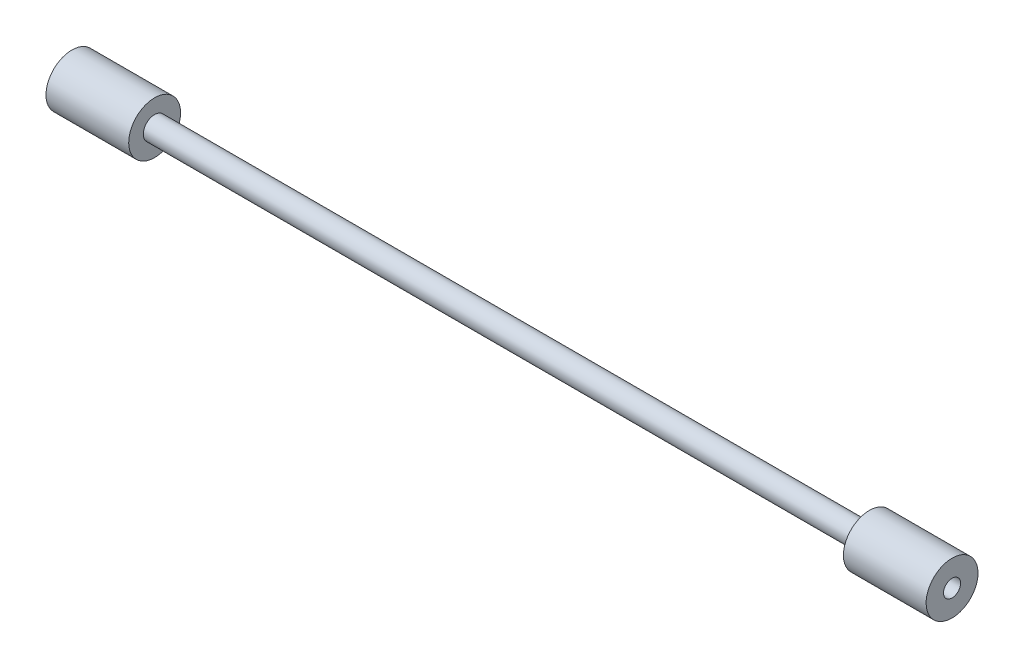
ISO-10303-21;
HEADER;
FILE_DESCRIPTION(('STEP AP214'),'2;1');
FILE_NAME('part.step','',(''),(''),'','','');
FILE_SCHEMA(('AUTOMOTIVE_DESIGN { 1 0 10303 214 1 1 1 1 }'));
ENDSEC;
DATA;
#1=APPLICATION_CONTEXT('core data for automotive mechanical design processes');
#2=APPLICATION_PROTOCOL_DEFINITION('international standard','automotive_design',2000,#1);
#3=PRODUCT_CONTEXT('',#1,'mechanical');
#4=PRODUCT('Part','Part','',(#3));
#5=PRODUCT_RELATED_PRODUCT_CATEGORY('part','',(#4));
#6=PRODUCT_DEFINITION_FORMATION('','',#4);
#7=PRODUCT_DEFINITION_CONTEXT('part definition',#1,'design');
#8=PRODUCT_DEFINITION('design','',#6,#7);
#9=PRODUCT_DEFINITION_SHAPE('','',#8);
#10=(LENGTH_UNIT() NAMED_UNIT(*) SI_UNIT(.MILLI.,.METRE.));
#11=(NAMED_UNIT(*) PLANE_ANGLE_UNIT() SI_UNIT($,.RADIAN.));
#12=(NAMED_UNIT(*) SI_UNIT($,.STERADIAN.) SOLID_ANGLE_UNIT());
#13=UNCERTAINTY_MEASURE_WITH_UNIT(LENGTH_MEASURE(1.E-05),#10,'distance_accuracy_value','');
#14=(GEOMETRIC_REPRESENTATION_CONTEXT(3) GLOBAL_UNCERTAINTY_ASSIGNED_CONTEXT((#13)) GLOBAL_UNIT_ASSIGNED_CONTEXT((#10,
#11,#12)) REPRESENTATION_CONTEXT('',''));
#15=CARTESIAN_POINT('',(0.,0.,0.));
#16=DIRECTION('',(0.,0.,1.));
#17=DIRECTION('',(1.,0.,0.));
#18=AXIS2_PLACEMENT_3D('',#15,#16,#17);
#19=CARTESIAN_POINT('',(420.90625,13.6921875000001,0.));
#20=DIRECTION('',(-1.,0.,0.));
#21=DIRECTION('',(0.,-1.,0.));
#22=AXIS2_PLACEMENT_3D('',#19,#20,#21);
#23=PLANE('',#22);
#24=CARTESIAN_POINT('',(420.90625,0.,0.));
#25=DIRECTION('',(1.,0.,0.));
#26=DIRECTION('',(0.,1.,0.));
#27=AXIS2_PLACEMENT_3D('',#24,#25,#26);
#28=CIRCLE('',#27,6.);
#29=CARTESIAN_POINT('',(420.90625,6.00000000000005,0.));
#30=VERTEX_POINT('',#29);
#31=EDGE_CURVE('E67',#30,#30,#28,.T.);
#32=ORIENTED_EDGE('',*,*,#31,.T.);
#33=EDGE_LOOP('',(#32));
#34=FACE_BOUND('',#33,.T.);
#35=CARTESIAN_POINT('',(420.90625,0.,0.));
#36=DIRECTION('',(1.,0.,0.));
#37=DIRECTION('',(0.,1.,0.));
#38=AXIS2_PLACEMENT_3D('',#35,#36,#37);
#39=CIRCLE('',#38,13.6921875);
#40=CARTESIAN_POINT('',(420.90625,13.6921875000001,0.));
#41=VERTEX_POINT('',#40);
#42=EDGE_CURVE('E10',#41,#41,#39,.T.);
#43=ORIENTED_EDGE('',*,*,#42,.F.);
#44=EDGE_LOOP('',(#43));
#45=FACE_BOUND('',#44,.T.);
#46=ADVANCED_FACE('F33',(#34,#45),#23,.T.);
#47=CARTESIAN_POINT('',(0.,0.,0.));
#48=DIRECTION('',(1.,0.,0.));
#49=DIRECTION('',(0.,1.,0.));
#50=AXIS2_PLACEMENT_3D('',#47,#48,#49);
#51=CYLINDRICAL_SURFACE('',#50,13.6921875);
#52=ORIENTED_EDGE('',*,*,#42,.T.);
#53=EDGE_LOOP('',(#52));
#54=FACE_BOUND('',#53,.T.);
#55=CARTESIAN_POINT('',(464.5625,0.,0.));
#56=DIRECTION('',(1.,0.,0.));
#57=DIRECTION('',(0.,1.,0.));
#58=AXIS2_PLACEMENT_3D('',#55,#56,#57);
#59=CIRCLE('',#58,13.6921875);
#60=CARTESIAN_POINT('',(464.5625,13.6921875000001,0.));
#61=VERTEX_POINT('',#60);
#62=EDGE_CURVE('E39',#61,#61,#59,.T.);
#63=ORIENTED_EDGE('',*,*,#62,.F.);
#64=EDGE_LOOP('',(#63));
#65=FACE_BOUND('',#64,.T.);
#66=ADVANCED_FACE('F85',(#54,#65),#51,.T.);
#67=CARTESIAN_POINT('',(464.5625,4.5,0.));
#68=DIRECTION('',(1.,0.,0.));
#69=DIRECTION('',(0.,1.,0.));
#70=AXIS2_PLACEMENT_3D('',#67,#68,#69);
#71=PLANE('',#70);
#72=ORIENTED_EDGE('',*,*,#62,.T.);
#73=EDGE_LOOP('',(#72));
#74=FACE_BOUND('',#73,.T.);
#75=CARTESIAN_POINT('',(464.5625,0.,0.));
#76=DIRECTION('',(1.,0.,0.));
#77=DIRECTION('',(0.,1.,0.));
#78=AXIS2_PLACEMENT_3D('',#75,#76,#77);
#79=CIRCLE('',#78,4.49999999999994);
#80=CARTESIAN_POINT('',(464.5625,4.5,0.));
#81=VERTEX_POINT('',#80);
#82=EDGE_CURVE('E43',#81,#81,#79,.T.);
#83=ORIENTED_EDGE('',*,*,#82,.F.);
#84=EDGE_LOOP('',(#83));
#85=FACE_BOUND('',#84,.T.);
#86=ADVANCED_FACE('F89',(#74,#85),#71,.T.);
#87=CARTESIAN_POINT('',(0.,0.,0.));
#88=DIRECTION('',(1.,0.,0.));
#89=DIRECTION('',(0.,1.,0.));
#90=AXIS2_PLACEMENT_3D('',#87,#88,#89);
#91=CYLINDRICAL_SURFACE('',#90,4.49999999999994);
#92=ORIENTED_EDGE('',*,*,#82,.T.);
#93=EDGE_LOOP('',(#92));
#94=FACE_BOUND('',#93,.T.);
#95=CARTESIAN_POINT('',(436.78125,0.,0.));
#96=DIRECTION('',(1.,0.,0.));
#97=DIRECTION('',(0.,1.,0.));
#98=AXIS2_PLACEMENT_3D('',#95,#96,#97);
#99=CIRCLE('',#98,4.49999999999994);
#100=CARTESIAN_POINT('',(436.78125,4.5,0.));
#101=VERTEX_POINT('',#100);
#102=EDGE_CURVE('E47',#101,#101,#99,.T.);
#103=ORIENTED_EDGE('',*,*,#102,.F.);
#104=EDGE_LOOP('',(#103));
#105=FACE_BOUND('',#104,.T.);
#106=ADVANCED_FACE('F93',(#94,#105),#91,.F.);
#107=CARTESIAN_POINT('',(436.78125,4.5,0.));
#108=DIRECTION('',(1.,0.,0.));
#109=DIRECTION('',(0.,1.,0.));
#110=AXIS2_PLACEMENT_3D('',#107,#108,#109);
#111=PLANE('',#110);
#112=ORIENTED_EDGE('',*,*,#102,.T.);
#113=EDGE_LOOP('',(#112));
#114=FACE_BOUND('',#113,.T.);
#115=ADVANCED_FACE('F99',(#114),#111,.T.);
#116=CARTESIAN_POINT('',(27.78125,4.49999999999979,0.));
#117=DIRECTION('',(-1.,0.,0.));
#118=DIRECTION('',(0.,-1.,0.));
#119=AXIS2_PLACEMENT_3D('',#116,#117,#118);
#120=PLANE('',#119);
#121=CARTESIAN_POINT('',(27.7812500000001,0.,0.));
#122=DIRECTION('',(1.,0.,0.));
#123=DIRECTION('',(0.,1.,0.));
#124=AXIS2_PLACEMENT_3D('',#121,#122,#123);
#125=CIRCLE('',#124,4.49999999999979);
#126=CARTESIAN_POINT('',(27.7812500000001,4.49999999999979,0.));
#127=VERTEX_POINT('',#126);
#128=EDGE_CURVE('E52',#127,#127,#125,.T.);
#129=ORIENTED_EDGE('',*,*,#128,.F.);
#130=EDGE_LOOP('',(#129));
#131=FACE_BOUND('',#130,.T.);
#132=ADVANCED_FACE('F103',(#131),#120,.T.);
#133=CARTESIAN_POINT('',(0.,0.,0.));
#134=DIRECTION('',(1.,0.,0.));
#135=DIRECTION('',(0.,1.,0.));
#136=AXIS2_PLACEMENT_3D('',#133,#134,#135);
#137=CYLINDRICAL_SURFACE('',#136,4.4999999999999);
#138=ORIENTED_EDGE('',*,*,#128,.T.);
#139=EDGE_LOOP('',(#138));
#140=FACE_BOUND('',#139,.T.);
#141=CARTESIAN_POINT('',(0.,0.,0.));
#142=DIRECTION('',(1.,0.,0.));
#143=DIRECTION('',(0.,1.,0.));
#144=AXIS2_PLACEMENT_3D('',#141,#142,#143);
#145=CIRCLE('',#144,4.5);
#146=CARTESIAN_POINT('',(0.,4.5,0.));
#147=VERTEX_POINT('',#146);
#148=EDGE_CURVE('E55',#147,#147,#145,.T.);
#149=ORIENTED_EDGE('',*,*,#148,.F.);
#150=EDGE_LOOP('',(#149));
#151=FACE_BOUND('',#150,.T.);
#152=ADVANCED_FACE('F107',(#140,#151),#137,.F.);
#153=CARTESIAN_POINT('',(0.,13.6921875,0.));
#154=DIRECTION('',(-1.,0.,0.));
#155=DIRECTION('',(0.,-1.,0.));
#156=AXIS2_PLACEMENT_3D('',#153,#154,#155);
#157=PLANE('',#156);
#158=ORIENTED_EDGE('',*,*,#148,.T.);
#159=EDGE_LOOP('',(#158));
#160=FACE_BOUND('',#159,.T.);
#161=CARTESIAN_POINT('',(0.,0.,0.));
#162=DIRECTION('',(1.,0.,0.));
#163=DIRECTION('',(0.,1.,0.));
#164=AXIS2_PLACEMENT_3D('',#161,#162,#163);
#165=CIRCLE('',#164,13.6921875);
#166=CARTESIAN_POINT('',(0.,13.6921875,0.));
#167=VERTEX_POINT('',#166);
#168=EDGE_CURVE('E58',#167,#167,#165,.T.);
#169=ORIENTED_EDGE('',*,*,#168,.F.);
#170=EDGE_LOOP('',(#169));
#171=FACE_BOUND('',#170,.T.);
#172=ADVANCED_FACE('F111',(#160,#171),#157,.T.);
#173=CARTESIAN_POINT('',(0.,0.,0.));
#174=DIRECTION('',(1.,0.,0.));
#175=DIRECTION('',(0.,1.,0.));
#176=AXIS2_PLACEMENT_3D('',#173,#174,#175);
#177=CYLINDRICAL_SURFACE('',#176,13.6921875);
#178=ORIENTED_EDGE('',*,*,#168,.T.);
#179=EDGE_LOOP('',(#178));
#180=FACE_BOUND('',#179,.T.);
#181=CARTESIAN_POINT('',(43.65625,0.,0.));
#182=DIRECTION('',(1.,0.,0.));
#183=DIRECTION('',(0.,1.,0.));
#184=AXIS2_PLACEMENT_3D('',#181,#182,#183);
#185=CIRCLE('',#184,13.6921875);
#186=CARTESIAN_POINT('',(43.65625,13.6921875,0.));
#187=VERTEX_POINT('',#186);
#188=EDGE_CURVE('E61',#187,#187,#185,.T.);
#189=ORIENTED_EDGE('',*,*,#188,.F.);
#190=EDGE_LOOP('',(#189));
#191=FACE_BOUND('',#190,.T.);
#192=ADVANCED_FACE('F81',(#180,#191),#177,.T.);
#193=CARTESIAN_POINT('',(43.65625,6.00000000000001,0.));
#194=DIRECTION('',(1.,0.,0.));
#195=DIRECTION('',(0.,1.,0.));
#196=AXIS2_PLACEMENT_3D('',#193,#194,#195);
#197=PLANE('',#196);
#198=ORIENTED_EDGE('',*,*,#188,.T.);
#199=EDGE_LOOP('',(#198));
#200=FACE_BOUND('',#199,.T.);
#201=CARTESIAN_POINT('',(43.65625,0.,0.));
#202=DIRECTION('',(1.,0.,0.));
#203=DIRECTION('',(0.,1.,0.));
#204=AXIS2_PLACEMENT_3D('',#201,#202,#203);
#205=CIRCLE('',#204,6.);
#206=CARTESIAN_POINT('',(43.65625,6.00000000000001,0.));
#207=VERTEX_POINT('',#206);
#208=EDGE_CURVE('E64',#207,#207,#205,.T.);
#209=ORIENTED_EDGE('',*,*,#208,.F.);
#210=EDGE_LOOP('',(#209));
#211=FACE_BOUND('',#210,.T.);
#212=ADVANCED_FACE('F75',(#200,#211),#197,.T.);
#213=CARTESIAN_POINT('',(0.,0.,0.));
#214=DIRECTION('',(1.,0.,0.));
#215=DIRECTION('',(0.,1.,0.));
#216=AXIS2_PLACEMENT_3D('',#213,#214,#215);
#217=CYLINDRICAL_SURFACE('',#216,6.);
#218=ORIENTED_EDGE('',*,*,#208,.T.);
#219=EDGE_LOOP('',(#218));
#220=FACE_BOUND('',#219,.T.);
#221=ORIENTED_EDGE('',*,*,#31,.F.);
#222=EDGE_LOOP('',(#221));
#223=FACE_BOUND('',#222,.T.);
#224=ADVANCED_FACE('F73',(#220,#223),#217,.T.);
#225=CLOSED_SHELL('',(#46,#66,#86,#106,#115,#132,#152,#172,#192,#212,#224));
#226=MANIFOLD_SOLID_BREP('B2',#225);
#227=ADVANCED_BREP_SHAPE_REPRESENTATION('',(#18,#226),#14);
#228=SHAPE_DEFINITION_REPRESENTATION(#9,#227);
ENDSEC;
END-ISO-10303-21;
